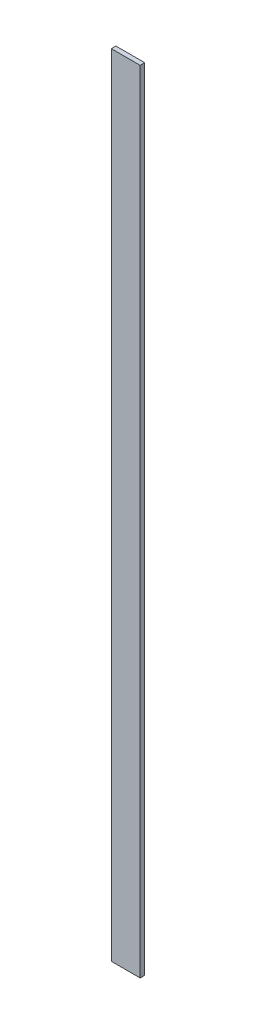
ISO-10303-21;
HEADER;
FILE_DESCRIPTION(('STEP AP214'),'2;1');
FILE_NAME('part.step','',(''),(''),'','','');
FILE_SCHEMA(('AUTOMOTIVE_DESIGN { 1 0 10303 214 1 1 1 1 }'));
ENDSEC;
DATA;
#1=APPLICATION_CONTEXT('core data for automotive mechanical design processes');
#2=APPLICATION_PROTOCOL_DEFINITION('international standard','automotive_design',2000,#1);
#3=PRODUCT_CONTEXT('',#1,'mechanical');
#4=PRODUCT('Part','Part','',(#3));
#5=PRODUCT_RELATED_PRODUCT_CATEGORY('part','',(#4));
#6=PRODUCT_DEFINITION_FORMATION('','',#4);
#7=PRODUCT_DEFINITION_CONTEXT('part definition',#1,'design');
#8=PRODUCT_DEFINITION('design','',#6,#7);
#9=PRODUCT_DEFINITION_SHAPE('','',#8);
#10=(LENGTH_UNIT() NAMED_UNIT(*) SI_UNIT(.MILLI.,.METRE.));
#11=(NAMED_UNIT(*) PLANE_ANGLE_UNIT() SI_UNIT($,.RADIAN.));
#12=(NAMED_UNIT(*) SI_UNIT($,.STERADIAN.) SOLID_ANGLE_UNIT());
#13=UNCERTAINTY_MEASURE_WITH_UNIT(LENGTH_MEASURE(1.E-05),#10,'distance_accuracy_value','');
#14=(GEOMETRIC_REPRESENTATION_CONTEXT(3) GLOBAL_UNCERTAINTY_ASSIGNED_CONTEXT((#13)) GLOBAL_UNIT_ASSIGNED_CONTEXT((#10,
#11,#12)) REPRESENTATION_CONTEXT('',''));
#15=CARTESIAN_POINT('',(0.,0.,0.));
#16=DIRECTION('',(0.,0.,1.));
#17=DIRECTION('',(1.,0.,0.));
#18=AXIS2_PLACEMENT_3D('',#15,#16,#17);
#19=CARTESIAN_POINT('',(-109.994944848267,0.00023001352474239,-91.450376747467));
#20=DIRECTION('',(5.01871176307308E-07,-1.04947696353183E-12,-0.999999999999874));
#21=DIRECTION('',(-0.999999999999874,0.,-5.01871176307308E-07));
#22=AXIS2_PLACEMENT_3D('',#19,#20,#21);
#23=PLANE('',#22);
#24=DIRECTION('',(0.999999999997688,-2.09112818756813E-06,5.01871176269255E-07));
#25=VECTOR('',#24,1.);
#26=CARTESIAN_POINT('',(-110.005818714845,-5199.99976997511,-91.450376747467));
#27=LINE('',#26,#25);
#28=CARTESIAN_POINT('',(-110.005818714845,-5199.99976997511,-91.450376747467));
#29=VERTEX_POINT('',#28);
#30=CARTESIAN_POINT('',(79.9941812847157,-5200.00016728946,-91.4502813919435));
#31=VERTEX_POINT('',#30);
#32=EDGE_CURVE('E68',#29,#31,#27,.T.);
#33=ORIENTED_EDGE('',*,*,#32,.F.);
#34=DIRECTION('',(-2.09112818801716E-06,-0.999999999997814,0.));
#35=VECTOR('',#34,1.);
#36=CARTESIAN_POINT('',(-109.994944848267,0.000230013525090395,-91.450376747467));
#37=LINE('',#36,#35);
#38=CARTESIAN_POINT('',(-109.994944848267,0.00023001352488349,-91.450376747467));
#39=VERTEX_POINT('',#38);
#40=EDGE_CURVE('E55',#39,#29,#37,.T.);
#41=ORIENTED_EDGE('',*,*,#40,.F.);
#42=DIRECTION('',(-0.999999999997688,2.0911281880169E-06,-5.01871176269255E-07));
#43=VECTOR('',#42,1.);
#44=CARTESIAN_POINT('',(80.0050551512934,-0.000167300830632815,-91.4502813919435));
#45=LINE('',#44,#43);
#46=CARTESIAN_POINT('',(80.0050551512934,-0.000167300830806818,-91.4502813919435));
#47=VERTEX_POINT('',#46);
#48=EDGE_CURVE('E20',#47,#39,#45,.T.);
#49=ORIENTED_EDGE('',*,*,#48,.F.);
#50=DIRECTION('',(2.09112818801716E-06,0.999999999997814,0.));
#51=VECTOR('',#50,1.);
#52=CARTESIAN_POINT('',(80.0050551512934,-0.000167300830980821,-91.4502813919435));
#53=LINE('',#52,#51);
#54=EDGE_CURVE('E81',#31,#47,#53,.T.);
#55=ORIENTED_EDGE('',*,*,#54,.F.);
#56=EDGE_LOOP('',(#33,#41,#49,#55));
#57=FACE_BOUND('',#56,.T.);
#58=ADVANCED_FACE('F17',(#57),#23,.T.);
#59=CARTESIAN_POINT('',(-109.994959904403,0.000230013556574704,-61.4503767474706));
#60=DIRECTION('',(2.09112818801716E-06,0.999999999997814,0.));
#61=DIRECTION('',(-0.999999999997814,2.09112818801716E-06,0.));
#62=AXIS2_PLACEMENT_3D('',#59,#60,#61);
#63=PLANE('',#62);
#64=ORIENTED_EDGE('',*,*,#48,.T.);
#65=DIRECTION('',(-5.01871172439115E-07,1.04947695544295E-12,0.999999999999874));
#66=VECTOR('',#65,1.);
#67=CARTESIAN_POINT('',(-109.994959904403,0.000230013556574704,-61.4503767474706));
#68=LINE('',#67,#66);
#69=CARTESIAN_POINT('',(-109.994959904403,0.000230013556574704,-61.4503767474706));
#70=VERTEX_POINT('',#69);
#71=EDGE_CURVE('E61',#70,#39,#68,.F.);
#72=ORIENTED_EDGE('',*,*,#71,.F.);
#73=DIRECTION('',(-0.999999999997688,2.0911281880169E-06,-5.01871176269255E-07));
#74=VECTOR('',#73,1.);
#75=CARTESIAN_POINT('',(80.0050400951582,-0.000167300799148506,-61.4502813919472));
#76=LINE('',#75,#74);
#77=CARTESIAN_POINT('',(80.0050400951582,-0.00016730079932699,-61.4502813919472));
#78=VERTEX_POINT('',#77);
#79=EDGE_CURVE('E83',#78,#70,#76,.T.);
#80=ORIENTED_EDGE('',*,*,#79,.F.);
#81=DIRECTION('',(-5.01871172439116E-07,1.04947695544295E-12,0.999999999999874));
#82=VECTOR('',#81,1.);
#83=CARTESIAN_POINT('',(80.0050551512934,-0.000167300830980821,-91.4502813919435));
#84=LINE('',#83,#82);
#85=EDGE_CURVE('E64',#47,#78,#84,.T.);
#86=ORIENTED_EDGE('',*,*,#85,.F.);
#87=EDGE_LOOP('',(#64,#72,#80,#86));
#88=FACE_BOUND('',#87,.T.);
#89=ADVANCED_FACE('F60',(#88),#63,.T.);
#90=CARTESIAN_POINT('',(-109.994959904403,0.000230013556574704,-61.4503767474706));
#91=DIRECTION('',(-0.999999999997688,2.0911281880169E-06,-5.01871172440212E-07));
#92=DIRECTION('',(-2.09112818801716E-06,-0.999999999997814,0.));
#93=AXIS2_PLACEMENT_3D('',#90,#91,#92);
#94=PLANE('',#93);
#95=DIRECTION('',(5.01871172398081E-07,-1.06581410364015E-12,-0.999999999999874));
#96=VECTOR('',#95,1.);
#97=CARTESIAN_POINT('',(-110.00583377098,-5199.99976997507,-61.4503767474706));
#98=LINE('',#97,#96);
#99=CARTESIAN_POINT('',(-110.00583377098,-5199.99976997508,-61.4503767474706));
#100=VERTEX_POINT('',#99);
#101=EDGE_CURVE('E70',#100,#29,#98,.T.);
#102=ORIENTED_EDGE('',*,*,#101,.F.);
#103=DIRECTION('',(-2.0911281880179E-06,-0.999999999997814,0.));
#104=VECTOR('',#103,1.);
#105=CARTESIAN_POINT('',(-109.994959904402,0.000230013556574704,-61.4503767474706));
#106=LINE('',#105,#104);
#107=EDGE_CURVE('E74',#70,#100,#106,.T.);
#108=ORIENTED_EDGE('',*,*,#107,.F.);
#109=ORIENTED_EDGE('',*,*,#71,.T.);
#110=ORIENTED_EDGE('',*,*,#40,.T.);
#111=EDGE_LOOP('',(#102,#108,#109,#110));
#112=FACE_BOUND('',#111,.T.);
#113=ADVANCED_FACE('F72',(#112),#94,.T.);
#114=CARTESIAN_POINT('',(79.9941812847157,-5200.00016728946,-91.4502813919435));
#115=DIRECTION('',(-2.09112818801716E-06,-0.999999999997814,0.));
#116=DIRECTION('',(0.999999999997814,-2.09112818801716E-06,0.));
#117=AXIS2_PLACEMENT_3D('',#114,#115,#116);
#118=PLANE('',#117);
#119=ORIENTED_EDGE('',*,*,#101,.T.);
#120=ORIENTED_EDGE('',*,*,#32,.T.);
#121=DIRECTION('',(-5.01871172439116E-07,1.04947695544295E-12,0.999999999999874));
#122=VECTOR('',#121,1.);
#123=CARTESIAN_POINT('',(79.9941812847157,-5200.00016728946,-91.4502813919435));
#124=LINE('',#123,#122);
#125=CARTESIAN_POINT('',(79.9941662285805,-5200.00016728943,-61.4502813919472));
#126=VERTEX_POINT('',#125);
#127=EDGE_CURVE('E35',#126,#31,#124,.F.);
#128=ORIENTED_EDGE('',*,*,#127,.F.);
#129=DIRECTION('',(0.999999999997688,-2.09112818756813E-06,5.01871176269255E-07));
#130=VECTOR('',#129,1.);
#131=CARTESIAN_POINT('',(-110.00583377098,-5199.99976997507,-61.4503767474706));
#132=LINE('',#131,#130);
#133=EDGE_CURVE('E26',#100,#126,#132,.T.);
#134=ORIENTED_EDGE('',*,*,#133,.F.);
#135=EDGE_LOOP('',(#119,#120,#128,#134));
#136=FACE_BOUND('',#135,.T.);
#137=ADVANCED_FACE('F89',(#136),#118,.T.);
#138=CARTESIAN_POINT('',(80.0050551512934,-0.000167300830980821,-91.4502813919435));
#139=DIRECTION('',(0.999999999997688,-2.0911281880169E-06,5.01871172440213E-07));
#140=DIRECTION('',(2.09112818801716E-06,0.999999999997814,0.));
#141=AXIS2_PLACEMENT_3D('',#138,#139,#140);
#142=PLANE('',#141);
#143=ORIENTED_EDGE('',*,*,#127,.T.);
#144=ORIENTED_EDGE('',*,*,#54,.T.);
#145=ORIENTED_EDGE('',*,*,#85,.T.);
#146=DIRECTION('',(2.0911281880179E-06,0.999999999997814,0.));
#147=VECTOR('',#146,1.);
#148=CARTESIAN_POINT('',(79.9941662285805,-5200.00016728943,-61.4502813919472));
#149=LINE('',#148,#147);
#150=EDGE_CURVE('E11',#126,#78,#149,.T.);
#151=ORIENTED_EDGE('',*,*,#150,.F.);
#152=EDGE_LOOP('',(#143,#144,#145,#151));
#153=FACE_BOUND('',#152,.T.);
#154=ADVANCED_FACE('F91',(#153),#142,.T.);
#155=CARTESIAN_POINT('',(80.0050400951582,-0.000167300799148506,-61.4502813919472));
#156=DIRECTION('',(-5.01871176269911E-07,1.04947696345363E-12,0.999999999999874));
#157=DIRECTION('',(0.999999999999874,0.,5.01871176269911E-07));
#158=AXIS2_PLACEMENT_3D('',#155,#156,#157);
#159=PLANE('',#158);
#160=ORIENTED_EDGE('',*,*,#133,.T.);
#161=ORIENTED_EDGE('',*,*,#150,.T.);
#162=ORIENTED_EDGE('',*,*,#79,.T.);
#163=ORIENTED_EDGE('',*,*,#107,.T.);
#164=EDGE_LOOP('',(#160,#161,#162,#163));
#165=FACE_BOUND('',#164,.T.);
#166=ADVANCED_FACE('F88',(#165),#159,.T.);
#167=CLOSED_SHELL('',(#58,#89,#113,#137,#154,#166));
#168=MANIFOLD_SOLID_BREP('B1',#167);
#169=ADVANCED_BREP_SHAPE_REPRESENTATION('',(#18,#168),#14);
#170=SHAPE_DEFINITION_REPRESENTATION(#9,#169);
ENDSEC;
END-ISO-10303-21;
